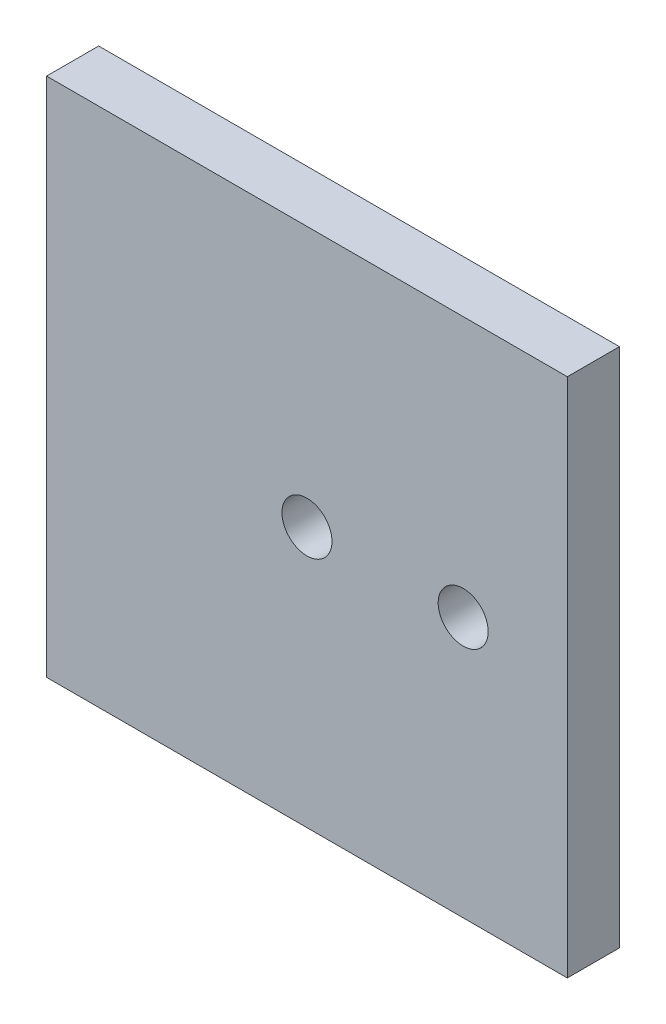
from build123d import *

# Parameters (mm, degrees)
SKETCH1_W          = 127
SKETCH1_H          = 127
EXTRUDE1_DEPTH     = 12.7
SKETCH2_R          = 6.1
CUT_EXTRUDE1_DEPTH = 181.05357536
SKETCH3_R          = 6.1
CUT_EXTRUDE2_DEPTH = 203.391267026


with BuildPart() as part:
    # Sketch1 → Extrude1 (new body)
    with BuildSketch(Plane.XY):
        with Locations((63.5, 63.5)):
            Rectangle(SKETCH1_W, SKETCH1_H)
    extrude(amount=EXTRUDE1_DEPTH)

    # Sketch2 → Cut-Extrude1 (cut, through all)
    with BuildSketch(Plane.XY.offset(12.7)):
        with Locations((101.6, 63.5)):
            Circle(SKETCH2_R)
    extrude(amount=-CUT_EXTRUDE1_DEPTH, mode=Mode.SUBTRACT)

    # Sketch3 → Cut-Extrude2 (cut, through all)
    with BuildSketch(Plane(origin=(-27.787295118, -2.77606959, 12.7), x_dir=(1, 0, 0), z_dir=(0, 0, 1))):
        with Locations((91.287295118, 66.27606959)):
            Circle(SKETCH3_R)
    extrude(amount=-CUT_EXTRUDE2_DEPTH, mode=Mode.SUBTRACT)


solid = part.part
